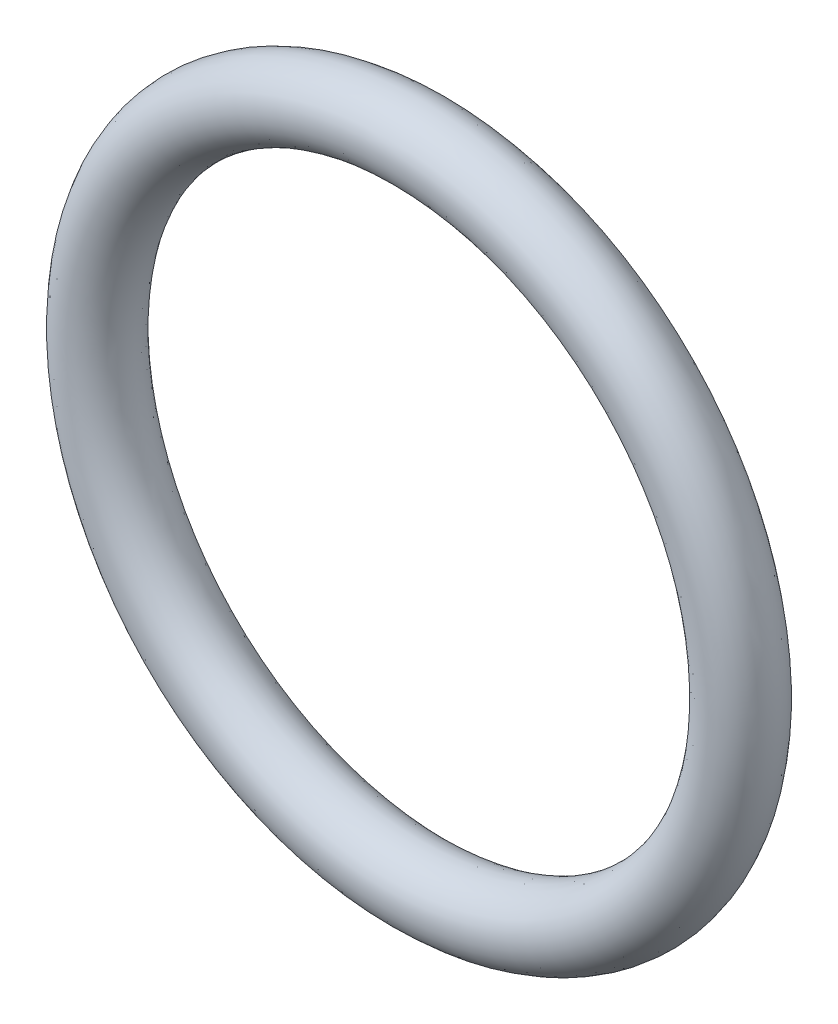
from build123d import *

# Parameters (mm, degrees)
ESQUISSE1_RX = 1.575
ESQUISSE1_RY = 1.575


with BuildPart() as part:
    # Esquisse1 → Base-R_volution (revolve)
    with BuildSketch(Plane(origin=(0, 0, 0), x_dir=(0, 0, -1), z_dir=(1, 0, 0))):
        with Locations((1.575, 14.075)):
            Ellipse(ESQUISSE1_RX, ESQUISSE1_RY)
    revolve(axis=Axis((0, 0, 0), (0, 0, -1)))


solid = part.part
